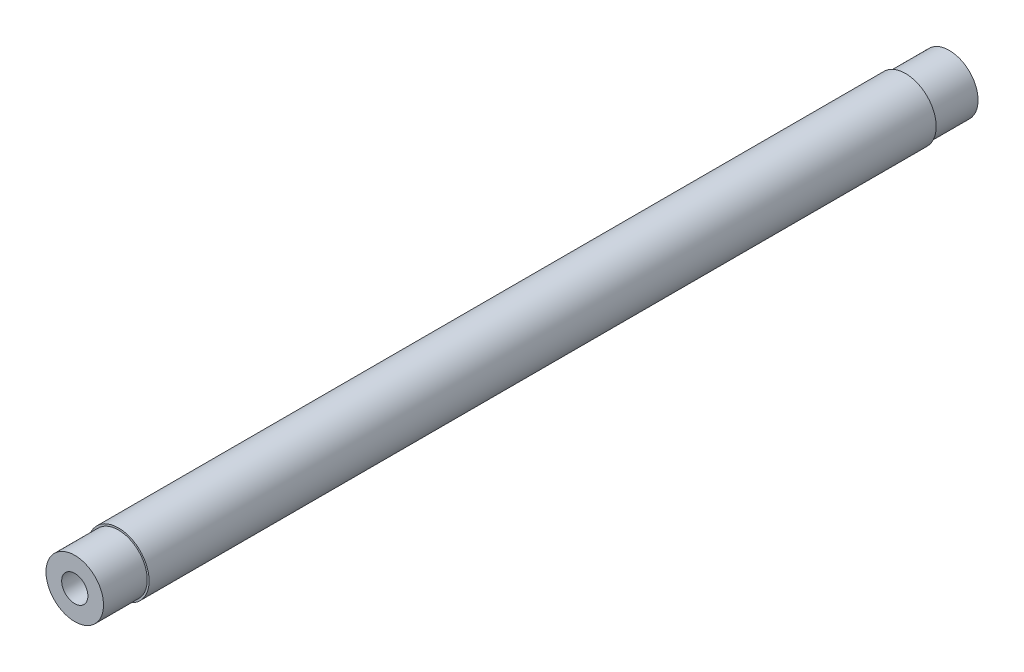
ISO-10303-21;
HEADER;
FILE_DESCRIPTION(('STEP AP214'),'2;1');
FILE_NAME('part.step','',(''),(''),'','','');
FILE_SCHEMA(('AUTOMOTIVE_DESIGN { 1 0 10303 214 1 1 1 1 }'));
ENDSEC;
DATA;
#1=APPLICATION_CONTEXT('core data for automotive mechanical design processes');
#2=APPLICATION_PROTOCOL_DEFINITION('international standard','automotive_design',2000,#1);
#3=PRODUCT_CONTEXT('',#1,'mechanical');
#4=PRODUCT('Part','Part','',(#3));
#5=PRODUCT_RELATED_PRODUCT_CATEGORY('part','',(#4));
#6=PRODUCT_DEFINITION_FORMATION('','',#4);
#7=PRODUCT_DEFINITION_CONTEXT('part definition',#1,'design');
#8=PRODUCT_DEFINITION('design','',#6,#7);
#9=PRODUCT_DEFINITION_SHAPE('','',#8);
#10=(LENGTH_UNIT() NAMED_UNIT(*) SI_UNIT(.MILLI.,.METRE.));
#11=(NAMED_UNIT(*) PLANE_ANGLE_UNIT() SI_UNIT($,.RADIAN.));
#12=(NAMED_UNIT(*) SI_UNIT($,.STERADIAN.) SOLID_ANGLE_UNIT());
#13=UNCERTAINTY_MEASURE_WITH_UNIT(LENGTH_MEASURE(1.E-05),#10,'distance_accuracy_value','');
#14=(GEOMETRIC_REPRESENTATION_CONTEXT(3) GLOBAL_UNCERTAINTY_ASSIGNED_CONTEXT((#13)) GLOBAL_UNIT_ASSIGNED_CONTEXT((#10,
#11,#12)) REPRESENTATION_CONTEXT('',''));
#15=CARTESIAN_POINT('',(0.,0.,0.));
#16=DIRECTION('',(0.,0.,1.));
#17=DIRECTION('',(1.,0.,0.));
#18=AXIS2_PLACEMENT_3D('',#15,#16,#17);
#19=CARTESIAN_POINT('',(0.,0.,100.));
#20=DIRECTION('',(0.,0.,-1.));
#21=DIRECTION('',(-1.,0.,0.));
#22=AXIS2_PLACEMENT_3D('',#19,#20,#21);
#23=CYLINDRICAL_SURFACE('',#22,7.);
#24=CARTESIAN_POINT('',(0.,0.,-90.));
#25=DIRECTION('',(0.,0.,-1.));
#26=DIRECTION('',(-1.,0.,0.));
#27=AXIS2_PLACEMENT_3D('',#24,#25,#26);
#28=CIRCLE('',#27,7.);
#29=CARTESIAN_POINT('',(-6.99999999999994,0.,-90.));
#30=VERTEX_POINT('',#29);
#31=EDGE_CURVE('E26',#30,#30,#28,.T.);
#32=ORIENTED_EDGE('',*,*,#31,.F.);
#33=EDGE_LOOP('',(#32));
#34=FACE_BOUND('',#33,.T.);
#35=CARTESIAN_POINT('',(0.,0.,90.));
#36=DIRECTION('',(0.,0.,1.));
#37=DIRECTION('',(1.,0.,0.));
#38=AXIS2_PLACEMENT_3D('',#35,#36,#37);
#39=CIRCLE('',#38,7.);
#40=CARTESIAN_POINT('',(7.00000000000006,0.,90.));
#41=VERTEX_POINT('',#40);
#42=EDGE_CURVE('E17',#41,#41,#39,.T.);
#43=ORIENTED_EDGE('',*,*,#42,.F.);
#44=EDGE_LOOP('',(#43));
#45=FACE_BOUND('',#44,.T.);
#46=ADVANCED_FACE('F14',(#34,#45),#23,.T.);
#47=CARTESIAN_POINT('',(0.,0.,-100.));
#48=DIRECTION('',(0.,0.,1.));
#49=DIRECTION('',(1.,0.,0.));
#50=AXIS2_PLACEMENT_3D('',#47,#48,#49);
#51=PLANE('',#50);
#52=CARTESIAN_POINT('',(0.,0.,-100.));
#53=DIRECTION('',(0.,0.,1.));
#54=DIRECTION('',(1.,0.,0.));
#55=AXIS2_PLACEMENT_3D('',#52,#53,#54);
#56=CIRCLE('',#55,3.);
#57=CARTESIAN_POINT('',(3.00000000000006,0.,-100.));
#58=VERTEX_POINT('',#57);
#59=EDGE_CURVE('E21',#58,#58,#56,.T.);
#60=ORIENTED_EDGE('',*,*,#59,.T.);
#61=EDGE_LOOP('',(#60));
#62=FACE_BOUND('',#61,.T.);
#63=CARTESIAN_POINT('',(0.,0.,-100.));
#64=DIRECTION('',(0.,0.,-1.));
#65=DIRECTION('',(-1.,0.,0.));
#66=AXIS2_PLACEMENT_3D('',#63,#64,#65);
#67=CIRCLE('',#66,6.5785);
#68=CARTESIAN_POINT('',(-6.57849999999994,0.,-100.));
#69=VERTEX_POINT('',#68);
#70=EDGE_CURVE('E29',#69,#69,#67,.T.);
#71=ORIENTED_EDGE('',*,*,#70,.T.);
#72=EDGE_LOOP('',(#71));
#73=FACE_BOUND('',#72,.T.);
#74=ADVANCED_FACE('F53',(#62,#73),#51,.F.);
#75=CARTESIAN_POINT('',(0.,0.,100.));
#76=DIRECTION('',(0.,0.,1.));
#77=DIRECTION('',(1.,0.,0.));
#78=AXIS2_PLACEMENT_3D('',#75,#76,#77);
#79=PLANE('',#78);
#80=CARTESIAN_POINT('',(0.,0.,100.));
#81=DIRECTION('',(0.,0.,-1.));
#82=DIRECTION('',(-1.,0.,0.));
#83=AXIS2_PLACEMENT_3D('',#80,#81,#82);
#84=CIRCLE('',#83,6.5785);
#85=CARTESIAN_POINT('',(-6.5785,0.,100.));
#86=VERTEX_POINT('',#85);
#87=EDGE_CURVE('E40',#86,#86,#84,.T.);
#88=ORIENTED_EDGE('',*,*,#87,.F.);
#89=EDGE_LOOP('',(#88));
#90=FACE_BOUND('',#89,.T.);
#91=CARTESIAN_POINT('',(0.,0.,100.));
#92=DIRECTION('',(0.,0.,1.));
#93=DIRECTION('',(1.,0.,0.));
#94=AXIS2_PLACEMENT_3D('',#91,#92,#93);
#95=CIRCLE('',#94,3.);
#96=CARTESIAN_POINT('',(3.,0.,100.));
#97=VERTEX_POINT('',#96);
#98=EDGE_CURVE('E10',#97,#97,#95,.T.);
#99=ORIENTED_EDGE('',*,*,#98,.F.);
#100=EDGE_LOOP('',(#99));
#101=FACE_BOUND('',#100,.T.);
#102=ADVANCED_FACE('F60',(#90,#101),#79,.T.);
#103=CARTESIAN_POINT('',(0.,0.,100.));
#104=DIRECTION('',(0.,0.,-1.));
#105=DIRECTION('',(-1.,0.,0.));
#106=AXIS2_PLACEMENT_3D('',#103,#104,#105);
#107=CYLINDRICAL_SURFACE('',#106,3.);
#108=ORIENTED_EDGE('',*,*,#98,.T.);
#109=EDGE_LOOP('',(#108));
#110=FACE_BOUND('',#109,.T.);
#111=ORIENTED_EDGE('',*,*,#59,.F.);
#112=EDGE_LOOP('',(#111));
#113=FACE_BOUND('',#112,.T.);
#114=ADVANCED_FACE('F66',(#110,#113),#107,.F.);
#115=CARTESIAN_POINT('',(0.,0.,-90.));
#116=DIRECTION('',(0.,0.,-1.));
#117=DIRECTION('',(-1.,0.,0.));
#118=AXIS2_PLACEMENT_3D('',#115,#116,#117);
#119=PLANE('',#118);
#120=CARTESIAN_POINT('',(0.,0.,-90.));
#121=DIRECTION('',(0.,0.,-1.));
#122=DIRECTION('',(-1.,0.,0.));
#123=AXIS2_PLACEMENT_3D('',#120,#121,#122);
#124=CIRCLE('',#123,6.5785);
#125=CARTESIAN_POINT('',(-6.57849999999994,0.,-90.));
#126=VERTEX_POINT('',#125);
#127=EDGE_CURVE('E32',#126,#126,#124,.T.);
#128=ORIENTED_EDGE('',*,*,#127,.F.);
#129=EDGE_LOOP('',(#128));
#130=FACE_BOUND('',#129,.T.);
#131=ORIENTED_EDGE('',*,*,#31,.T.);
#132=EDGE_LOOP('',(#131));
#133=FACE_BOUND('',#132,.T.);
#134=ADVANCED_FACE('F73',(#130,#133),#119,.T.);
#135=CARTESIAN_POINT('',(0.,0.,-90.));
#136=DIRECTION('',(0.,0.,-1.));
#137=DIRECTION('',(-1.,0.,0.));
#138=AXIS2_PLACEMENT_3D('',#135,#136,#137);
#139=CYLINDRICAL_SURFACE('',#138,6.5785);
#140=ORIENTED_EDGE('',*,*,#127,.T.);
#141=EDGE_LOOP('',(#140));
#142=FACE_BOUND('',#141,.T.);
#143=ORIENTED_EDGE('',*,*,#70,.F.);
#144=EDGE_LOOP('',(#143));
#145=FACE_BOUND('',#144,.T.);
#146=ADVANCED_FACE('F76',(#142,#145),#139,.T.);
#147=CARTESIAN_POINT('',(0.,0.,90.));
#148=DIRECTION('',(0.,0.,1.));
#149=DIRECTION('',(1.,0.,0.));
#150=AXIS2_PLACEMENT_3D('',#147,#148,#149);
#151=PLANE('',#150);
#152=CARTESIAN_POINT('',(0.,0.,90.));
#153=DIRECTION('',(0.,0.,-1.));
#154=DIRECTION('',(-1.,0.,0.));
#155=AXIS2_PLACEMENT_3D('',#152,#153,#154);
#156=CIRCLE('',#155,6.5785);
#157=CARTESIAN_POINT('',(-6.57849999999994,0.,90.));
#158=VERTEX_POINT('',#157);
#159=EDGE_CURVE('E43',#158,#158,#156,.T.);
#160=ORIENTED_EDGE('',*,*,#159,.T.);
#161=EDGE_LOOP('',(#160));
#162=FACE_BOUND('',#161,.T.);
#163=ORIENTED_EDGE('',*,*,#42,.T.);
#164=EDGE_LOOP('',(#163));
#165=FACE_BOUND('',#164,.T.);
#166=ADVANCED_FACE('F50',(#162,#165),#151,.T.);
#167=CARTESIAN_POINT('',(0.,0.,90.));
#168=DIRECTION('',(0.,0.,1.));
#169=DIRECTION('',(1.,0.,0.));
#170=AXIS2_PLACEMENT_3D('',#167,#168,#169);
#171=CYLINDRICAL_SURFACE('',#170,6.5785);
#172=ORIENTED_EDGE('',*,*,#159,.F.);
#173=EDGE_LOOP('',(#172));
#174=FACE_BOUND('',#173,.T.);
#175=ORIENTED_EDGE('',*,*,#87,.T.);
#176=EDGE_LOOP('',(#175));
#177=FACE_BOUND('',#176,.T.);
#178=ADVANCED_FACE('F82',(#174,#177),#171,.T.);
#179=CLOSED_SHELL('',(#46,#74,#102,#114,#134,#146,#166,#178));
#180=MANIFOLD_SOLID_BREP('B1',#179);
#181=ADVANCED_BREP_SHAPE_REPRESENTATION('',(#18,#180),#14);
#182=SHAPE_DEFINITION_REPRESENTATION(#9,#181);
ENDSEC;
END-ISO-10303-21;
